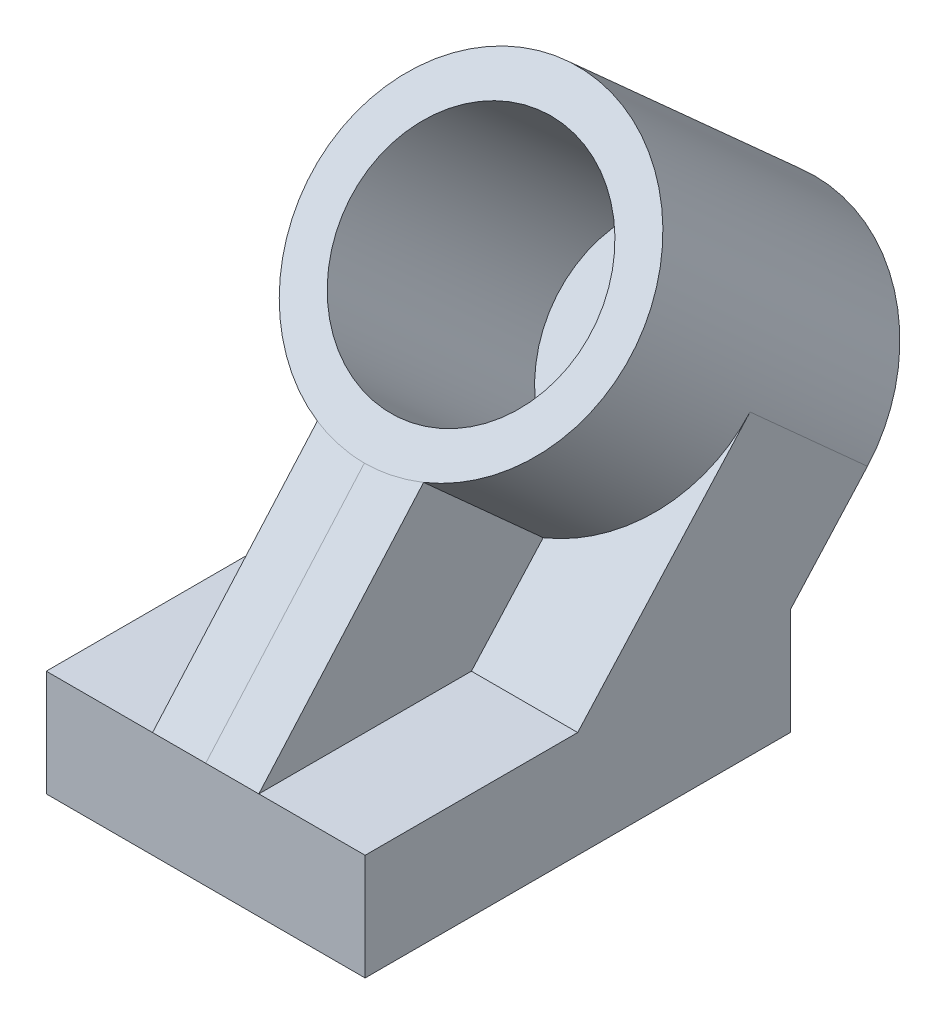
ISO-10303-21;
HEADER;
FILE_DESCRIPTION(('STEP AP214'),'2;1');
FILE_NAME('part.step','',(''),(''),'','','');
FILE_SCHEMA(('AUTOMOTIVE_DESIGN { 1 0 10303 214 1 1 1 1 }'));
ENDSEC;
DATA;
#1=APPLICATION_CONTEXT('core data for automotive mechanical design processes');
#2=APPLICATION_PROTOCOL_DEFINITION('international standard','automotive_design',2000,#1);
#3=PRODUCT_CONTEXT('',#1,'mechanical');
#4=PRODUCT('Part','Part','',(#3));
#5=PRODUCT_RELATED_PRODUCT_CATEGORY('part','',(#4));
#6=PRODUCT_DEFINITION_FORMATION('','',#4);
#7=PRODUCT_DEFINITION_CONTEXT('part definition',#1,'design');
#8=PRODUCT_DEFINITION('design','',#6,#7);
#9=PRODUCT_DEFINITION_SHAPE('','',#8);
#10=(LENGTH_UNIT() NAMED_UNIT(*) SI_UNIT(.MILLI.,.METRE.));
#11=(NAMED_UNIT(*) PLANE_ANGLE_UNIT() SI_UNIT($,.RADIAN.));
#12=(NAMED_UNIT(*) SI_UNIT($,.STERADIAN.) SOLID_ANGLE_UNIT());
#13=UNCERTAINTY_MEASURE_WITH_UNIT(LENGTH_MEASURE(1.E-05),#10,'distance_accuracy_value','');
#14=(GEOMETRIC_REPRESENTATION_CONTEXT(3) GLOBAL_UNCERTAINTY_ASSIGNED_CONTEXT((#13)) GLOBAL_UNIT_ASSIGNED_CONTEXT((#10,
#11,#12)) REPRESENTATION_CONTEXT('',''));
#15=CARTESIAN_POINT('',(0.,0.,0.));
#16=DIRECTION('',(0.,0.,1.));
#17=DIRECTION('',(1.,0.,0.));
#18=AXIS2_PLACEMENT_3D('',#15,#16,#17);
#19=CARTESIAN_POINT('',(-76.2,0.,0.));
#20=DIRECTION('',(0.,1.,0.));
#21=DIRECTION('',(0.,0.,1.));
#22=AXIS2_PLACEMENT_3D('',#19,#20,#21);
#23=PLANE('',#22);
#24=DIRECTION('',(1.,0.,0.));
#25=VECTOR('',#24,1.);
#26=CARTESIAN_POINT('',(-76.2,0.,0.));
#27=LINE('',#26,#25);
#28=CARTESIAN_POINT('',(-76.2,0.,0.));
#29=VERTEX_POINT('',#28);
#30=CARTESIAN_POINT('',(-50.8,0.,0.));
#31=VERTEX_POINT('',#30);
#32=EDGE_CURVE('E94',#29,#31,#27,.T.);
#33=ORIENTED_EDGE('',*,*,#32,.T.);
#34=DIRECTION('',(0.,0.,-1.));
#35=VECTOR('',#34,1.);
#36=CARTESIAN_POINT('',(-50.8,0.,-50.8));
#37=LINE('',#36,#35);
#38=CARTESIAN_POINT('',(-50.8,0.,-50.8));
#39=VERTEX_POINT('',#38);
#40=EDGE_CURVE('E319',#31,#39,#37,.T.);
#41=ORIENTED_EDGE('',*,*,#40,.T.);
#42=DIRECTION('',(1.,0.,0.));
#43=VECTOR('',#42,1.);
#44=CARTESIAN_POINT('',(-76.2,0.,-50.8));
#45=LINE('',#44,#43);
#46=CARTESIAN_POINT('',(-76.2,0.,-50.8));
#47=VERTEX_POINT('',#46);
#48=EDGE_CURVE('E340',#47,#39,#45,.T.);
#49=ORIENTED_EDGE('',*,*,#48,.F.);
#50=DIRECTION('',(0.,0.,1.));
#51=VECTOR('',#50,1.);
#52=CARTESIAN_POINT('',(-76.2,0.,0.));
#53=LINE('',#52,#51);
#54=EDGE_CURVE('E337',#47,#29,#53,.T.);
#55=ORIENTED_EDGE('',*,*,#54,.T.);
#56=EDGE_LOOP('',(#33,#41,#49,#55));
#57=FACE_BOUND('',#56,.T.);
#58=ADVANCED_FACE('F85',(#57),#23,.T.);
#59=CARTESIAN_POINT('',(-76.2,0.,-50.8));
#60=DIRECTION('',(0.,0.669130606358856,0.743144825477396));
#61=DIRECTION('',(0.,-0.743144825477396,0.669130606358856));
#62=AXIS2_PLACEMENT_3D('',#59,#60,#61);
#63=PLANE('',#62);
#64=DIRECTION('',(0.,0.743144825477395,-0.669130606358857));
#65=VECTOR('',#64,1.);
#66=CARTESIAN_POINT('',(-50.8,19.0490347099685,-67.9518278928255));
#67=LINE('',#66,#65);
#68=CARTESIAN_POINT('',(-50.8,19.0490347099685,-67.9518278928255));
#69=VERTEX_POINT('',#68);
#70=EDGE_CURVE('E277',#39,#69,#67,.T.);
#71=ORIENTED_EDGE('',*,*,#70,.T.);
#72=CARTESIAN_POINT('',(-38.1,45.7435581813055,-91.9876847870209));
#73=DIRECTION('',(0.,0.669130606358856,0.743144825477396));
#74=DIRECTION('',(0.,-0.743144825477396,0.669130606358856));
#75=AXIS2_PLACEMENT_3D('',#72,#73,#74);
#76=CIRCLE('',#75,38.1);
#77=CARTESIAN_POINT('',(-76.2,45.7435581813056,-91.9876847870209));
#78=VERTEX_POINT('',#77);
#79=EDGE_CURVE('E361',#78,#69,#76,.T.);
#80=ORIENTED_EDGE('',*,*,#79,.F.);
#81=DIRECTION('',(0.,-0.743144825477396,0.669130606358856));
#82=VECTOR('',#81,1.);
#83=CARTESIAN_POINT('',(-76.2,0.,-50.8));
#84=LINE('',#83,#82);
#85=EDGE_CURVE('E380',#78,#47,#84,.T.);
#86=ORIENTED_EDGE('',*,*,#85,.T.);
#87=ORIENTED_EDGE('',*,*,#48,.T.);
#88=EDGE_LOOP('',(#71,#80,#86,#87));
#89=FACE_BOUND('',#88,.T.);
#90=ADVANCED_FACE('F446',(#89),#63,.T.);
#91=CARTESIAN_POINT('',(-38.1,71.4704542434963,-63.4150720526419));
#92=DIRECTION('',(0.,-0.669130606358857,-0.743144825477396));
#93=DIRECTION('',(0.,0.743144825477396,-0.669130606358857));
#94=AXIS2_PLACEMENT_3D('',#91,#92,#93);
#95=CYLINDRICAL_SURFACE('',#94,38.1);
#96=DIRECTION('',(0.,0.669130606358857,0.743144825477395));
#97=VECTOR('',#96,1.);
#98=CARTESIAN_POINT('',(-50.8,44.7759307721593,-39.3792151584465));
#99=LINE('',#98,#97);
#100=CARTESIAN_POINT('',(-50.8,44.7759307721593,-39.3792151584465));
#101=VERTEX_POINT('',#100);
#102=EDGE_CURVE('E198',#69,#101,#99,.T.);
#103=ORIENTED_EDGE('',*,*,#102,.T.);
#104=CARTESIAN_POINT('',(-38.1,71.4704542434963,-63.4150720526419));
#105=DIRECTION('',(0.,-0.669130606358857,-0.743144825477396));
#106=DIRECTION('',(0.,0.743144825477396,-0.669130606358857));
#107=AXIS2_PLACEMENT_3D('',#104,#105,#106);
#108=CIRCLE('',#107,38.1);
#109=CARTESIAN_POINT('',(-25.4,44.7759307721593,-39.3792151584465));
#110=VERTEX_POINT('',#109);
#111=EDGE_CURVE('E197',#101,#110,#108,.T.);
#112=ORIENTED_EDGE('',*,*,#111,.T.);
#113=DIRECTION('',(0.,0.669130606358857,0.743144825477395));
#114=VECTOR('',#113,1.);
#115=CARTESIAN_POINT('',(-25.4,44.7759307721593,-39.3792151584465));
#116=LINE('',#115,#114);
#117=CARTESIAN_POINT('',(-25.4,19.0490347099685,-67.9518278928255));
#118=VERTEX_POINT('',#117);
#119=EDGE_CURVE('E209',#118,#110,#116,.T.);
#120=ORIENTED_EDGE('',*,*,#119,.F.);
#121=CARTESIAN_POINT('',(0.,45.7435581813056,-91.9876847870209));
#122=VERTEX_POINT('',#121);
#123=EDGE_CURVE('E358',#118,#122,#76,.T.);
#124=ORIENTED_EDGE('',*,*,#123,.T.);
#125=DIRECTION('',(0.,0.669130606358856,0.743144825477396));
#126=VECTOR('',#125,1.);
#127=CARTESIAN_POINT('',(0.,20.4827020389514,-120.042707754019));
#128=LINE('',#127,#126);
#129=CARTESIAN_POINT('',(0.,20.4827020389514,-120.042707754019));
#130=VERTEX_POINT('',#129);
#131=EDGE_CURVE('E397',#130,#122,#128,.T.);
#132=ORIENTED_EDGE('',*,*,#131,.F.);
#133=CARTESIAN_POINT('',(-38.1,20.4827020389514,-120.042707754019));
#134=DIRECTION('',(0.,-0.669130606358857,-0.743144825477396));
#135=DIRECTION('',(0.,0.743144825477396,-0.669130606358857));
#136=AXIS2_PLACEMENT_3D('',#133,#134,#135);
#137=CIRCLE('',#136,38.1);
#138=CARTESIAN_POINT('',(-76.2,20.4827020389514,-120.042707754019));
#139=VERTEX_POINT('',#138);
#140=EDGE_CURVE('E365',#139,#130,#137,.T.);
#141=ORIENTED_EDGE('',*,*,#140,.F.);
#142=DIRECTION('',(0.,0.669130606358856,0.743144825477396));
#143=VECTOR('',#142,1.);
#144=CARTESIAN_POINT('',(-76.2,20.4827020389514,-120.042707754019));
#145=LINE('',#144,#143);
#146=EDGE_CURVE('E378',#139,#78,#145,.T.);
#147=ORIENTED_EDGE('',*,*,#146,.T.);
#148=ORIENTED_EDGE('',*,*,#79,.T.);
#149=EDGE_LOOP('',(#103,#112,#120,#124,#132,#141,#147,#148));
#150=FACE_BOUND('',#149,.T.);
#151=ADVANCED_FACE('F288',(#150),#95,.T.);
#152=CARTESIAN_POINT('',(-38.1,71.4704542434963,-63.4150720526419));
#153=DIRECTION('',(0.,-0.669130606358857,-0.743144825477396));
#154=DIRECTION('',(0.,0.743144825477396,-0.669130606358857));
#155=AXIS2_PLACEMENT_3D('',#152,#153,#154);
#156=CYLINDRICAL_SURFACE('',#155,28.575);
#157=CARTESIAN_POINT('',(-38.1,71.4704542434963,-63.4150720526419));
#158=DIRECTION('',(0.,-0.669130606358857,-0.743144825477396));
#159=DIRECTION('',(0.,0.743144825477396,-0.669130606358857));
#160=AXIS2_PLACEMENT_3D('',#157,#158,#159);
#161=CIRCLE('',#160,28.575);
#162=CARTESIAN_POINT('',(-38.1,92.7058176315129,-82.5354791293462));
#163=VERTEX_POINT('',#162);
#164=EDGE_CURVE('E208',#163,#163,#161,.T.);
#165=ORIENTED_EDGE('',*,*,#164,.F.);
#166=EDGE_LOOP('',(#165));
#167=FACE_BOUND('',#166,.T.);
#168=CARTESIAN_POINT('',(-38.1,26.8561710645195,-112.964253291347));
#169=DIRECTION('',(0.,-0.669130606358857,-0.743144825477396));
#170=DIRECTION('',(0.,0.743144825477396,-0.669130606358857));
#171=AXIS2_PLACEMENT_3D('',#168,#169,#170);
#172=CIRCLE('',#171,28.575);
#173=CARTESIAN_POINT('',(-38.1,48.0915344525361,-132.084660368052));
#174=VERTEX_POINT('',#173);
#175=EDGE_CURVE('E13',#174,#174,#172,.F.);
#176=ORIENTED_EDGE('',*,*,#175,.F.);
#177=EDGE_LOOP('',(#176));
#178=FACE_BOUND('',#177,.T.);
#179=ADVANCED_FACE('F458',(#167,#178),#156,.F.);
#180=CARTESIAN_POINT('',(-76.2,0.,0.));
#181=DIRECTION('',(0.,0.,1.));
#182=DIRECTION('',(0.,-1.,0.));
#183=AXIS2_PLACEMENT_3D('',#180,#181,#182);
#184=PLANE('',#183);
#185=DIRECTION('',(0.,-1.,0.));
#186=VECTOR('',#185,1.);
#187=CARTESIAN_POINT('',(0.,0.,0.));
#188=LINE('',#187,#186);
#189=CARTESIAN_POINT('',(0.,0.,0.));
#190=VERTEX_POINT('',#189);
#191=CARTESIAN_POINT('',(0.,-25.4,0.));
#192=VERTEX_POINT('',#191);
#193=EDGE_CURVE('E385',#190,#192,#188,.T.);
#194=ORIENTED_EDGE('',*,*,#193,.F.);
#195=CARTESIAN_POINT('',(-25.4,0.,0.));
#196=VERTEX_POINT('',#195);
#197=EDGE_CURVE('E338',#196,#190,#27,.T.);
#198=ORIENTED_EDGE('',*,*,#197,.F.);
#199=DIRECTION('',(1.,0.,0.));
#200=VECTOR('',#199,1.);
#201=CARTESIAN_POINT('',(-31.75,0.,0.));
#202=LINE('',#201,#200);
#203=CARTESIAN_POINT('',(-38.1,0.,0.));
#204=VERTEX_POINT('',#203);
#205=EDGE_CURVE('E186',#204,#196,#202,.T.);
#206=ORIENTED_EDGE('',*,*,#205,.F.);
#207=DIRECTION('',(-1.,0.,0.));
#208=VECTOR('',#207,1.);
#209=CARTESIAN_POINT('',(-44.45,0.,0.));
#210=LINE('',#209,#208);
#211=EDGE_CURVE('E110',#204,#31,#210,.T.);
#212=ORIENTED_EDGE('',*,*,#211,.T.);
#213=ORIENTED_EDGE('',*,*,#32,.F.);
#214=DIRECTION('',(0.,-1.,0.));
#215=VECTOR('',#214,1.);
#216=CARTESIAN_POINT('',(-76.2,0.,0.));
#217=LINE('',#216,#215);
#218=CARTESIAN_POINT('',(-76.2,-25.4,0.));
#219=VERTEX_POINT('',#218);
#220=EDGE_CURVE('E366',#29,#219,#217,.T.);
#221=ORIENTED_EDGE('',*,*,#220,.T.);
#222=DIRECTION('',(1.,0.,0.));
#223=VECTOR('',#222,1.);
#224=CARTESIAN_POINT('',(-76.2,-25.4,0.));
#225=LINE('',#224,#223);
#226=EDGE_CURVE('E384',#219,#192,#225,.T.);
#227=ORIENTED_EDGE('',*,*,#226,.T.);
#228=EDGE_LOOP('',(#194,#198,#206,#212,#213,#221,#227));
#229=FACE_BOUND('',#228,.T.);
#230=ADVANCED_FACE('F87',(#229),#184,.T.);
#231=DIRECTION('',(0.,0.,-1.));
#232=VECTOR('',#231,1.);
#233=CARTESIAN_POINT('',(-25.4,0.,-50.8));
#234=LINE('',#233,#232);
#235=CARTESIAN_POINT('',(-25.4,0.,-50.8));
#236=VERTEX_POINT('',#235);
#237=EDGE_CURVE('E102',#196,#236,#234,.T.);
#238=ORIENTED_EDGE('',*,*,#237,.F.);
#239=ORIENTED_EDGE('',*,*,#197,.T.);
#240=DIRECTION('',(0.,0.,1.));
#241=VECTOR('',#240,1.);
#242=CARTESIAN_POINT('',(0.,0.,0.));
#243=LINE('',#242,#241);
#244=CARTESIAN_POINT('',(0.,0.,-50.8));
#245=VERTEX_POINT('',#244);
#246=EDGE_CURVE('E349',#245,#190,#243,.T.);
#247=ORIENTED_EDGE('',*,*,#246,.F.);
#248=EDGE_CURVE('E344',#236,#245,#45,.T.);
#249=ORIENTED_EDGE('',*,*,#248,.F.);
#250=EDGE_LOOP('',(#238,#239,#247,#249));
#251=FACE_BOUND('',#250,.T.);
#252=ADVANCED_FACE('F406',(#251),#23,.T.);
#253=DIRECTION('',(0.,0.743144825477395,-0.669130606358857));
#254=VECTOR('',#253,1.);
#255=CARTESIAN_POINT('',(-25.4,19.0490347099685,-67.9518278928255));
#256=LINE('',#255,#254);
#257=EDGE_CURVE('E428',#236,#118,#256,.T.);
#258=ORIENTED_EDGE('',*,*,#257,.F.);
#259=ORIENTED_EDGE('',*,*,#248,.T.);
#260=DIRECTION('',(0.,-0.743144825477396,0.669130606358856));
#261=VECTOR('',#260,1.);
#262=CARTESIAN_POINT('',(0.,0.,-50.8));
#263=LINE('',#262,#261);
#264=EDGE_CURVE('E399',#122,#245,#263,.T.);
#265=ORIENTED_EDGE('',*,*,#264,.F.);
#266=ORIENTED_EDGE('',*,*,#123,.F.);
#267=EDGE_LOOP('',(#258,#259,#265,#266));
#268=FACE_BOUND('',#267,.T.);
#269=ADVANCED_FACE('F427',(#268),#63,.T.);
#270=CARTESIAN_POINT('',(-76.2,0.,-101.6));
#271=DIRECTION('',(0.,-0.669130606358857,-0.743144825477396));
#272=DIRECTION('',(0.,0.743144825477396,-0.669130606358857));
#273=AXIS2_PLACEMENT_3D('',#270,#271,#272);
#274=PLANE('',#273);
#275=DIRECTION('',(0.,0.743144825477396,-0.669130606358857));
#276=VECTOR('',#275,1.);
#277=CARTESIAN_POINT('',(-76.2,0.,-101.6));
#278=LINE('',#277,#276);
#279=CARTESIAN_POINT('',(-76.2,0.,-101.6));
#280=VERTEX_POINT('',#279);
#281=EDGE_CURVE('E375',#280,#139,#278,.T.);
#282=ORIENTED_EDGE('',*,*,#281,.T.);
#283=ORIENTED_EDGE('',*,*,#140,.T.);
#284=DIRECTION('',(0.,0.743144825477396,-0.669130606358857));
#285=VECTOR('',#284,1.);
#286=CARTESIAN_POINT('',(0.,0.,-101.6));
#287=LINE('',#286,#285);
#288=CARTESIAN_POINT('',(0.,0.,-101.6));
#289=VERTEX_POINT('',#288);
#290=EDGE_CURVE('E394',#289,#130,#287,.T.);
#291=ORIENTED_EDGE('',*,*,#290,.F.);
#292=DIRECTION('',(1.,0.,0.));
#293=VECTOR('',#292,1.);
#294=CARTESIAN_POINT('',(-76.2,0.,-101.6));
#295=LINE('',#294,#293);
#296=EDGE_CURVE('E354',#280,#289,#295,.T.);
#297=ORIENTED_EDGE('',*,*,#296,.F.);
#298=EDGE_LOOP('',(#282,#283,#291,#297));
#299=FACE_BOUND('',#298,.T.);
#300=ADVANCED_FACE('F420',(#299),#274,.T.);
#301=CARTESIAN_POINT('',(-76.2,-25.4,-101.6));
#302=DIRECTION('',(0.,0.,-1.));
#303=DIRECTION('',(-1.,0.,0.));
#304=AXIS2_PLACEMENT_3D('',#301,#302,#303);
#305=PLANE('',#304);
#306=DIRECTION('',(0.,1.,0.));
#307=VECTOR('',#306,1.);
#308=CARTESIAN_POINT('',(0.,-25.4,-101.6));
#309=LINE('',#308,#307);
#310=CARTESIAN_POINT('',(0.,-25.4,-101.6));
#311=VERTEX_POINT('',#310);
#312=EDGE_CURVE('E391',#311,#289,#309,.T.);
#313=ORIENTED_EDGE('',*,*,#312,.F.);
#314=DIRECTION('',(1.,0.,0.));
#315=VECTOR('',#314,1.);
#316=CARTESIAN_POINT('',(-76.2,-25.4,-101.6));
#317=LINE('',#316,#315);
#318=CARTESIAN_POINT('',(-76.2,-25.4,-101.6));
#319=VERTEX_POINT('',#318);
#320=EDGE_CURVE('E410',#319,#311,#317,.T.);
#321=ORIENTED_EDGE('',*,*,#320,.F.);
#322=DIRECTION('',(0.,1.,0.));
#323=VECTOR('',#322,1.);
#324=CARTESIAN_POINT('',(-76.2,-25.4,-101.6));
#325=LINE('',#324,#323);
#326=EDGE_CURVE('E372',#319,#280,#325,.T.);
#327=ORIENTED_EDGE('',*,*,#326,.T.);
#328=ORIENTED_EDGE('',*,*,#296,.T.);
#329=EDGE_LOOP('',(#313,#321,#327,#328));
#330=FACE_BOUND('',#329,.T.);
#331=ADVANCED_FACE('F416',(#330),#305,.T.);
#332=CARTESIAN_POINT('',(-76.2,-25.4,0.));
#333=DIRECTION('',(0.,-1.,0.));
#334=DIRECTION('',(0.,0.,-1.));
#335=AXIS2_PLACEMENT_3D('',#332,#333,#334);
#336=PLANE('',#335);
#337=DIRECTION('',(0.,0.,-1.));
#338=VECTOR('',#337,1.);
#339=CARTESIAN_POINT('',(0.,-25.4,0.));
#340=LINE('',#339,#338);
#341=EDGE_CURVE('E388',#192,#311,#340,.T.);
#342=ORIENTED_EDGE('',*,*,#341,.F.);
#343=ORIENTED_EDGE('',*,*,#226,.F.);
#344=DIRECTION('',(0.,0.,-1.));
#345=VECTOR('',#344,1.);
#346=CARTESIAN_POINT('',(-76.2,-25.4,0.));
#347=LINE('',#346,#345);
#348=EDGE_CURVE('E369',#219,#319,#347,.T.);
#349=ORIENTED_EDGE('',*,*,#348,.T.);
#350=ORIENTED_EDGE('',*,*,#320,.T.);
#351=EDGE_LOOP('',(#342,#343,#349,#350));
#352=FACE_BOUND('',#351,.T.);
#353=ADVANCED_FACE('F412',(#352),#336,.T.);
#354=CARTESIAN_POINT('',(-76.2,0.,0.));
#355=DIRECTION('',(1.,0.,0.));
#356=DIRECTION('',(0.,0.,-1.));
#357=AXIS2_PLACEMENT_3D('',#354,#355,#356);
#358=PLANE('',#357);
#359=ORIENTED_EDGE('',*,*,#220,.F.);
#360=ORIENTED_EDGE('',*,*,#54,.F.);
#361=ORIENTED_EDGE('',*,*,#85,.F.);
#362=ORIENTED_EDGE('',*,*,#146,.F.);
#363=ORIENTED_EDGE('',*,*,#281,.F.);
#364=ORIENTED_EDGE('',*,*,#326,.F.);
#365=ORIENTED_EDGE('',*,*,#348,.F.);
#366=EDGE_LOOP('',(#359,#360,#361,#362,#363,#364,#365));
#367=FACE_BOUND('',#366,.T.);
#368=ADVANCED_FACE('F509',(#367),#358,.F.);
#369=CARTESIAN_POINT('',(0.,0.,0.));
#370=DIRECTION('',(1.,0.,0.));
#371=DIRECTION('',(0.,0.,-1.));
#372=AXIS2_PLACEMENT_3D('',#369,#370,#371);
#373=PLANE('',#372);
#374=ORIENTED_EDGE('',*,*,#193,.T.);
#375=ORIENTED_EDGE('',*,*,#341,.T.);
#376=ORIENTED_EDGE('',*,*,#312,.T.);
#377=ORIENTED_EDGE('',*,*,#290,.T.);
#378=ORIENTED_EDGE('',*,*,#131,.T.);
#379=ORIENTED_EDGE('',*,*,#264,.T.);
#380=ORIENTED_EDGE('',*,*,#246,.T.);
#381=EDGE_LOOP('',(#374,#375,#376,#377,#378,#379,#380));
#382=FACE_BOUND('',#381,.T.);
#383=ADVANCED_FACE('F405',(#382),#373,.T.);
#384=CARTESIAN_POINT('',(-38.1,71.4704542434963,-63.4150720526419));
#385=DIRECTION('',(0.,-0.669130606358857,-0.743144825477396));
#386=DIRECTION('',(0.,0.743144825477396,-0.669130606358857));
#387=AXIS2_PLACEMENT_3D('',#384,#385,#386);
#388=PLANE('',#387);
#389=ORIENTED_EDGE('',*,*,#164,.T.);
#390=EDGE_LOOP('',(#389));
#391=FACE_BOUND('',#390,.T.);
#392=ORIENTED_EDGE('',*,*,#111,.F.);
#393=CARTESIAN_POINT('',(-38.1,43.1566363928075,-37.9211959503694));
#394=CARTESIAN_POINT('',(-38.6496266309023,43.1566303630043,-37.9211906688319));
#395=CARTESIAN_POINT('',(-39.1992528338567,43.1654683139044,-37.929160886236));
#396=CARTESIAN_POINT('',(-40.2974117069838,43.2007925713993,-37.9610062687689));
#397=CARTESIAN_POINT('',(-40.8459444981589,43.2272768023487,-37.9848795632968));
#398=CARTESIAN_POINT('',(-41.9409557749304,43.2978541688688,-38.0484851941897));
#399=CARTESIAN_POINT('',(-42.4874342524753,43.3419473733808,-38.0882175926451));
#400=CARTESIAN_POINT('',(-43.57737336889,43.4476688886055,-38.1834657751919));
#401=CARTESIAN_POINT('',(-44.1208336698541,43.5092991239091,-38.2389832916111));
#402=CARTESIAN_POINT('',(-45.1834667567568,43.6473584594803,-38.3633290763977));
#403=CARTESIAN_POINT('',(-45.702789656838,43.7231501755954,-38.4315839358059));
#404=CARTESIAN_POINT('',(-46.7367946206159,43.8907609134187,-38.5825059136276));
#405=CARTESIAN_POINT('',(-47.2514761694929,43.982581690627,-38.6651746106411));
#406=CARTESIAN_POINT('',(-48.2756861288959,44.182175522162,-38.8448513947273));
#407=CARTESIAN_POINT('',(-48.7852097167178,44.2899622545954,-38.9418717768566));
#408=CARTESIAN_POINT('',(-49.7977166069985,44.5212260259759,-39.1500122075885));
#409=CARTESIAN_POINT('',(-50.3007005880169,44.6447014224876,-39.2611307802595));
#410=CARTESIAN_POINT('',(-50.8,44.7759307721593,-39.3792151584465));
#411=B_SPLINE_CURVE_WITH_KNOTS('',3,(#393,#394,#395,#396,#397,#398,#399,#400,#401,#402,#403,
#404,#405,#406,#407,#408,#409,#410),.UNSPECIFIED.,.F.,.F.,(4,2,2,2,2,2,2,2,4),(0.,
1.64875054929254,3.29730719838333,4.94587030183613,6.59461439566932,8.18189085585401,
9.7693412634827,11.3581595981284,12.9468117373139),.UNSPECIFIED.);
#412=CARTESIAN_POINT('',(-38.1,43.1566363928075,-37.9211959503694));
#413=VERTEX_POINT('',#412);
#414=EDGE_CURVE('E179',#413,#101,#411,.T.);
#415=ORIENTED_EDGE('',*,*,#414,.F.);
#416=CARTESIAN_POINT('',(-25.4,44.7759307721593,-39.3792151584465));
#417=CARTESIAN_POINT('',(-25.918190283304,44.639735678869,-39.2566624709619));
#418=CARTESIAN_POINT('',(-26.4403498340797,44.5118931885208,-39.1416133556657));
#419=CARTESIAN_POINT('',(-27.4915572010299,44.2731397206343,-38.9267303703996));
#420=CARTESIAN_POINT('',(-28.0206041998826,44.1622267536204,-38.82689471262));
#421=CARTESIAN_POINT('',(-29.0846606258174,43.9575261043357,-38.6426174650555));
#422=CARTESIAN_POINT('',(-29.6196700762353,43.8637384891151,-38.5581759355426));
#423=CARTESIAN_POINT('',(-30.6947078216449,43.6934503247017,-38.4048386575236));
#424=CARTESIAN_POINT('',(-31.2347366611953,43.6169516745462,-38.3359446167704));
#425=CARTESIAN_POINT('',(-32.2985306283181,43.4839223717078,-38.216124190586));
#426=CARTESIAN_POINT('',(-32.8221515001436,43.4267536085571,-38.1646237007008));
#427=CARTESIAN_POINT('',(-33.8722025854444,43.3286695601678,-38.0762534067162));
#428=CARTESIAN_POINT('',(-34.3986331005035,43.2877560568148,-38.0393852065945));
#429=CARTESIAN_POINT('',(-35.4537856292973,43.2222320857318,-37.9803323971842));
#430=CARTESIAN_POINT('',(-35.9825092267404,43.1976356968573,-37.9581604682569));
#431=CARTESIAN_POINT('',(-37.0408217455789,43.1648361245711,-37.9285907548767));
#432=CARTESIAN_POINT('',(-37.5704105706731,43.1566312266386,-37.9211914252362));
#433=CARTESIAN_POINT('',(-38.1,43.1566363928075,-37.9211959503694));
#434=B_SPLINE_CURVE_WITH_KNOTS('',3,(#416,#417,#418,#419,#420,#421,#422,#423,#424,#425,#426,
#427,#428,#429,#430,#431,#432,#433),.UNSPECIFIED.,.F.,.F.,(4,2,2,2,2,2,2,2,4),(0.,
1.64875055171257,3.2973072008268,4.9458703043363,6.59461439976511,8.18189086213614,
9.76934127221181,11.3581596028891,12.9468117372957),.UNSPECIFIED.);
#435=EDGE_CURVE('E194',#110,#413,#434,.T.);
#436=ORIENTED_EDGE('',*,*,#435,.F.);
#437=EDGE_LOOP('',(#392,#415,#436));
#438=FACE_BOUND('',#437,.T.);
#439=ADVANCED_FACE('F193',(#391,#438),#388,.F.);
#440=CARTESIAN_POINT('',(-38.1,26.8561710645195,-112.964253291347));
#441=DIRECTION('',(0.,-0.669130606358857,-0.743144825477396));
#442=DIRECTION('',(0.,0.743144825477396,-0.669130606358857));
#443=AXIS2_PLACEMENT_3D('',#440,#441,#442);
#444=PLANE('',#443);
#445=ORIENTED_EDGE('',*,*,#175,.T.);
#446=EDGE_LOOP('',(#445));
#447=FACE_BOUND('',#446,.T.);
#448=ADVANCED_FACE('F469',(#447),#444,.F.);
#449=CARTESIAN_POINT('',(-25.4,0.,0.));
#450=DIRECTION('',(1.,0.,0.));
#451=DIRECTION('',(0.,0.,-1.));
#452=AXIS2_PLACEMENT_3D('',#449,#450,#451);
#453=PLANE('',#452);
#454=ORIENTED_EDGE('',*,*,#257,.T.);
#455=ORIENTED_EDGE('',*,*,#119,.T.);
#456=DIRECTION('',(0.,-0.750909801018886,0.660404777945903));
#457=VECTOR('',#456,1.);
#458=CARTESIAN_POINT('',(-25.4,0.,0.));
#459=LINE('',#458,#457);
#460=EDGE_CURVE('E206',#110,#196,#459,.T.);
#461=ORIENTED_EDGE('',*,*,#460,.T.);
#462=ORIENTED_EDGE('',*,*,#237,.T.);
#463=EDGE_LOOP('',(#454,#455,#461,#462));
#464=FACE_BOUND('',#463,.T.);
#465=ADVANCED_FACE('F236',(#464),#453,.T.);
#466=CARTESIAN_POINT('',(-38.1,43.1566363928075,-37.9211959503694));
#467=CARTESIAN_POINT('',(-33.7790867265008,43.1566363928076,-37.9211959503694));
#468=CARTESIAN_POINT('',(-29.4581734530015,43.7384388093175,-38.4450531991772));
#469=CARTESIAN_POINT('',(-25.4,44.7759307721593,-39.3792151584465));
#470=CARTESIAN_POINT('',(-38.1,28.7710909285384,-25.2807973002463));
#471=CARTESIAN_POINT('',(-33.8082800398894,28.7710909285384,-25.2807973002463));
#472=CARTESIAN_POINT('',(-29.5165600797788,29.1589592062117,-25.6300354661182));
#473=CARTESIAN_POINT('',(-25.4,29.8506205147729,-26.252810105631));
#474=CARTESIAN_POINT('',(-38.1,14.3855454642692,-12.6403986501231));
#475=CARTESIAN_POINT('',(-33.837473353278,14.3855454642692,-12.6403986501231));
#476=CARTESIAN_POINT('',(-29.5749467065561,14.5794796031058,-12.8150177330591));
#477=CARTESIAN_POINT('',(-25.4,14.9253102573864,-13.1264050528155));
#478=CARTESIAN_POINT('',(-38.1,0.,0.));
#479=CARTESIAN_POINT('',(-33.8666666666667,0.,0.));
#480=CARTESIAN_POINT('',(-29.6333333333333,0.,0.));
#481=CARTESIAN_POINT('',(-25.4,0.,0.));
#482=B_SPLINE_SURFACE_WITH_KNOTS('',3,3,((#466,#467,#468,#469),(#470,#471,#472,#473),(#474,#475,
#476,#477),(#478,#479,#480,#481)),.UNSPECIFIED.,.F.,.F.,.F.,(4,4),(4,4),(0.,1.),(0.,1.),.UNSPECIFIED.);
#483=DIRECTION('',(0.,-0.751202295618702,0.660072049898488));
#484=VECTOR('',#483,1.);
#485=CARTESIAN_POINT('',(-38.1,0.,0.));
#486=LINE('',#485,#484);
#487=EDGE_CURVE('E175',#413,#204,#486,.T.);
#488=ORIENTED_EDGE('',*,*,#460,.F.);
#489=ORIENTED_EDGE('',*,*,#435,.T.);
#490=ORIENTED_EDGE('',*,*,#487,.T.);
#491=ORIENTED_EDGE('',*,*,#205,.T.);
#492=EDGE_LOOP('',(#488,#489,#490,#491));
#493=FACE_BOUND('',#492,.T.);
#494=ADVANCED_FACE('F204',(#493),#482,.T.);
#495=CARTESIAN_POINT('',(-50.8,0.,0.));
#496=DIRECTION('',(-1.,0.,0.));
#497=DIRECTION('',(0.,0.,-1.));
#498=AXIS2_PLACEMENT_3D('',#495,#496,#497);
#499=PLANE('',#498);
#500=ORIENTED_EDGE('',*,*,#70,.F.);
#501=ORIENTED_EDGE('',*,*,#40,.F.);
#502=DIRECTION('',(0.,-0.750909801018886,0.660404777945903));
#503=VECTOR('',#502,1.);
#504=CARTESIAN_POINT('',(-50.8,0.,0.));
#505=LINE('',#504,#503);
#506=EDGE_CURVE('E273',#101,#31,#505,.T.);
#507=ORIENTED_EDGE('',*,*,#506,.F.);
#508=ORIENTED_EDGE('',*,*,#102,.F.);
#509=EDGE_LOOP('',(#500,#501,#507,#508));
#510=FACE_BOUND('',#509,.T.);
#511=ADVANCED_FACE('F235',(#510),#499,.T.);
#512=CARTESIAN_POINT('',(-38.1,43.1566363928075,-37.9211959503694));
#513=CARTESIAN_POINT('',(-42.4209132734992,43.1566363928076,-37.9211959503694));
#514=CARTESIAN_POINT('',(-46.7418265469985,43.7384388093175,-38.4450531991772));
#515=CARTESIAN_POINT('',(-50.8,44.7759307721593,-39.3792151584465));
#516=CARTESIAN_POINT('',(-38.1,28.7710909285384,-25.2807973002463));
#517=CARTESIAN_POINT('',(-42.3917199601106,28.7710909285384,-25.2807973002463));
#518=CARTESIAN_POINT('',(-46.6834399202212,29.1589592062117,-25.6300354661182));
#519=CARTESIAN_POINT('',(-50.8,29.8506205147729,-26.252810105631));
#520=CARTESIAN_POINT('',(-38.1,14.3855454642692,-12.6403986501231));
#521=CARTESIAN_POINT('',(-42.362526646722,14.3855454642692,-12.6403986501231));
#522=CARTESIAN_POINT('',(-46.6250532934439,14.5794796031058,-12.8150177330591));
#523=CARTESIAN_POINT('',(-50.8,14.9253102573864,-13.1264050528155));
#524=CARTESIAN_POINT('',(-38.1,0.,0.));
#525=CARTESIAN_POINT('',(-42.3333333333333,0.,0.));
#526=CARTESIAN_POINT('',(-46.5666666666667,0.,0.));
#527=CARTESIAN_POINT('',(-50.8,0.,0.));
#528=B_SPLINE_SURFACE_WITH_KNOTS('',3,3,((#512,#513,#514,#515),(#516,#517,#518,#519),(#520,#521,
#522,#523),(#524,#525,#526,#527)),.UNSPECIFIED.,.F.,.F.,.F.,(4,4),(4,4),(0.,1.),(0.,1.),.UNSPECIFIED.);
#529=ORIENTED_EDGE('',*,*,#487,.F.);
#530=ORIENTED_EDGE('',*,*,#414,.T.);
#531=ORIENTED_EDGE('',*,*,#506,.T.);
#532=ORIENTED_EDGE('',*,*,#211,.F.);
#533=EDGE_LOOP('',(#529,#530,#531,#532));
#534=FACE_BOUND('',#533,.T.);
#535=ADVANCED_FACE('F178',(#534),#528,.F.);
#536=CLOSED_SHELL('',(#58,#90,#151,#179,#230,#252,#269,#300,#331,#353,#368,#383,#439,#448,#465,
#494,#511,#535));
#537=MANIFOLD_SOLID_BREP('B2',#536);
#538=ADVANCED_BREP_SHAPE_REPRESENTATION('',(#18,#537),#14);
#539=SHAPE_DEFINITION_REPRESENTATION(#9,#538);
ENDSEC;
END-ISO-10303-21;
